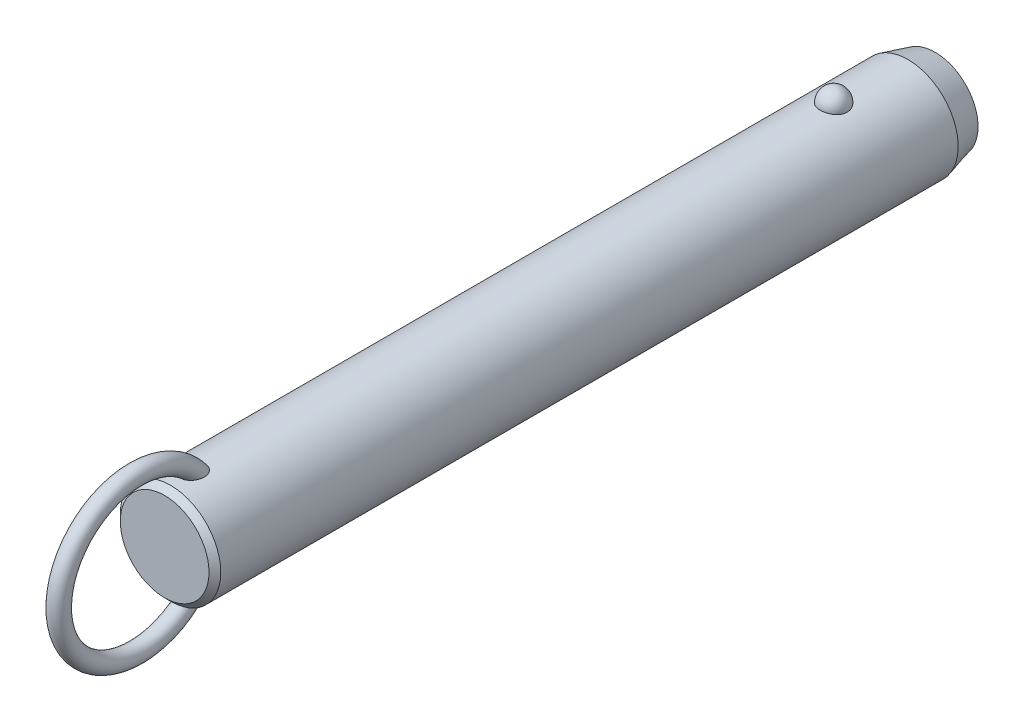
ISO-10303-21;
HEADER;
FILE_DESCRIPTION(('STEP AP214'),'2;1');
FILE_NAME('part.step','',(''),(''),'','','');
FILE_SCHEMA(('AUTOMOTIVE_DESIGN { 1 0 10303 214 1 1 1 1 }'));
ENDSEC;
DATA;
#1=APPLICATION_CONTEXT('core data for automotive mechanical design processes');
#2=APPLICATION_PROTOCOL_DEFINITION('international standard','automotive_design',2000,#1);
#3=PRODUCT_CONTEXT('',#1,'mechanical');
#4=PRODUCT('Part','Part','',(#3));
#5=PRODUCT_RELATED_PRODUCT_CATEGORY('part','',(#4));
#6=PRODUCT_DEFINITION_FORMATION('','',#4);
#7=PRODUCT_DEFINITION_CONTEXT('part definition',#1,'design');
#8=PRODUCT_DEFINITION('design','',#6,#7);
#9=PRODUCT_DEFINITION_SHAPE('','',#8);
#10=(LENGTH_UNIT() NAMED_UNIT(*) SI_UNIT(.MILLI.,.METRE.));
#11=(NAMED_UNIT(*) PLANE_ANGLE_UNIT() SI_UNIT($,.RADIAN.));
#12=(NAMED_UNIT(*) SI_UNIT($,.STERADIAN.) SOLID_ANGLE_UNIT());
#13=UNCERTAINTY_MEASURE_WITH_UNIT(LENGTH_MEASURE(1.E-05),#10,'distance_accuracy_value','');
#14=(GEOMETRIC_REPRESENTATION_CONTEXT(3) GLOBAL_UNCERTAINTY_ASSIGNED_CONTEXT((#13)) GLOBAL_UNIT_ASSIGNED_CONTEXT((#10,
#11,#12)) REPRESENTATION_CONTEXT('',''));
#15=CARTESIAN_POINT('',(0.,0.,0.));
#16=DIRECTION('',(0.,0.,1.));
#17=DIRECTION('',(1.,0.,0.));
#18=AXIS2_PLACEMENT_3D('',#15,#16,#17);
#19=CARTESIAN_POINT('',(0.,0.,132.1));
#20=DIRECTION('',(0.,0.,-1.));
#21=DIRECTION('',(-1.,0.,0.));
#22=AXIS2_PLACEMENT_3D('',#19,#20,#21);
#23=CYLINDRICAL_SURFACE('',#22,11.1);
#24=CARTESIAN_POINT('',(2.9724815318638,10.6945945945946,-3.));
#25=CARTESIAN_POINT('',(2.97247830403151,10.6945972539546,-2.83225059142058));
#26=CARTESIAN_POINT('',(2.95876598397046,10.6984356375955,-2.66445972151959));
#27=CARTESIAN_POINT('',(2.90424529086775,10.7133624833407,-2.33362381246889));
#28=CARTESIAN_POINT('',(2.8634252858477,10.7244540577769,-2.1705808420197));
#29=CARTESIAN_POINT('',(2.75573657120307,10.7526272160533,-1.85396767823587));
#30=CARTESIAN_POINT('',(2.68887937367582,10.7697061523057,-1.70039333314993));
#31=CARTESIAN_POINT('',(2.53079696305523,10.8079438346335,-1.40691598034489));
#32=CARTESIAN_POINT('',(2.43957264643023,10.8291024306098,-1.2670124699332));
#33=CARTESIAN_POINT('',(2.23458150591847,10.8732541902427,-1.00409565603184));
#34=CARTESIAN_POINT('',(2.12071295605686,10.8962553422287,-0.881162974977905));
#35=CARTESIAN_POINT('',(1.87365402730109,10.9414421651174,-0.656352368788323));
#36=CARTESIAN_POINT('',(1.74046358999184,10.9636278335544,-0.554474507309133));
#37=CARTESIAN_POINT('',(1.45872188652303,11.0046495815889,-0.374872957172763));
#38=CARTESIAN_POINT('',(1.31021276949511,11.0234944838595,-0.297085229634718));
#39=CARTESIAN_POINT('',(1.00170030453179,11.0557957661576,-0.167529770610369));
#40=CARTESIAN_POINT('',(0.841698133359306,11.0692526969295,-0.115759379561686));
#41=CARTESIAN_POINT('',(0.517607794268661,11.0890932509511,-0.0403925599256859));
#42=CARTESIAN_POINT('',(0.353633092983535,11.0955916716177,-0.0163383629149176));
#43=CARTESIAN_POINT('',(0.0238420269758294,11.1011989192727,0.0044517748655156));
#44=CARTESIAN_POINT('',(-0.141974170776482,11.1003084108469,0.00119017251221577));
#45=CARTESIAN_POINT('',(-0.468405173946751,11.0912990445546,-0.0323233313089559));
#46=CARTESIAN_POINT('',(-0.629059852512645,11.0832767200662,-0.0622147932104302));
#47=CARTESIAN_POINT('',(-0.942937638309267,11.0609962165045,-0.147645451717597));
#48=CARTESIAN_POINT('',(-1.09616062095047,11.0467379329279,-0.203185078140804));
#49=CARTESIAN_POINT('',(-1.39181061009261,11.0134071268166,-0.3387529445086));
#50=CARTESIAN_POINT('',(-1.53417383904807,10.9943086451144,-0.418913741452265));
#51=CARTESIAN_POINT('',(-1.80342160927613,10.9533667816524,-0.60144882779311));
#52=CARTESIAN_POINT('',(-1.9303046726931,10.9315231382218,-0.703825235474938));
#53=CARTESIAN_POINT('',(-2.16747598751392,10.887005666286,-0.930091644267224));
#54=CARTESIAN_POINT('',(-2.27742774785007,10.8643239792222,-1.05433291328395));
#55=CARTESIAN_POINT('',(-2.47517316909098,10.8209886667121,-1.31966633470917));
#56=CARTESIAN_POINT('',(-2.56296538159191,10.8003351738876,-1.46075958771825));
#57=CARTESIAN_POINT('',(-2.71500300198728,10.7631304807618,-1.75753646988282));
#58=CARTESIAN_POINT('',(-2.77898901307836,10.7466250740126,-1.91335887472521));
#59=CARTESIAN_POINT('',(-2.88046189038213,10.7198747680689,-2.2339152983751));
#60=CARTESIAN_POINT('',(-2.91794947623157,10.709629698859,-2.39864907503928));
#61=CARTESIAN_POINT('',(-2.96537819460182,10.6965949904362,-2.73165170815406));
#62=CARTESIAN_POINT('',(-2.97542891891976,10.693775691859,-2.89990378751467));
#63=CARTESIAN_POINT('',(-2.96804271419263,10.6958279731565,-3.235752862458));
#64=CARTESIAN_POINT('',(-2.95060646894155,10.7006993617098,-3.40334987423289));
#65=CARTESIAN_POINT('',(-2.88883358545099,10.71753912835,-3.73233906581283));
#66=CARTESIAN_POINT('',(-2.84462026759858,10.7294749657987,-3.89375610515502));
#67=CARTESIAN_POINT('',(-2.73050447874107,10.7590797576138,-4.20667949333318));
#68=CARTESIAN_POINT('',(-2.66060103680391,10.7767489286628,-4.35818546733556));
#69=CARTESIAN_POINT('',(-2.49642559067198,10.8159599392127,-4.6478542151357));
#70=CARTESIAN_POINT('',(-2.40203047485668,10.8375211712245,-4.78594458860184));
#71=CARTESIAN_POINT('',(-2.19143488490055,10.8820570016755,-5.0441038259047));
#72=CARTESIAN_POINT('',(-2.07523364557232,10.9050316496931,-5.16417205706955));
#73=CARTESIAN_POINT('',(-1.82361254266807,10.9499219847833,-5.38334833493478));
#74=CARTESIAN_POINT('',(-1.68812945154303,10.9718338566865,-5.48238464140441));
#75=CARTESIAN_POINT('',(-1.40191298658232,11.0120611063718,-5.65618873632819));
#76=CARTESIAN_POINT('',(-1.25118062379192,11.0303767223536,-5.73095813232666));
#77=CARTESIAN_POINT('',(-0.940570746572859,11.0611653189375,-5.85334725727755));
#78=CARTESIAN_POINT('',(-0.780821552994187,11.0737044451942,-5.90127578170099));
#79=CARTESIAN_POINT('',(-0.455204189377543,11.0918598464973,-5.96992976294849));
#80=CARTESIAN_POINT('',(-0.289336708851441,11.0974768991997,-5.99065827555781));
#81=CARTESIAN_POINT('',(0.0406846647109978,11.1011307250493,-6.00418773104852));
#82=CARTESIAN_POINT('',(0.204817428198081,11.099299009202,-5.99747318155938));
#83=CARTESIAN_POINT('',(0.5295530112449,11.088551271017,-5.9574031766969));
#84=CARTESIAN_POINT('',(0.69015594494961,11.0796354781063,-5.92404858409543));
#85=CARTESIAN_POINT('',(1.0027760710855,11.0557204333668,-5.83180084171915));
#86=CARTESIAN_POINT('',(1.15482001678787,11.0407414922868,-5.77299291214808));
#87=CARTESIAN_POINT('',(1.44678373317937,11.0062913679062,-5.63147366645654));
#88=CARTESIAN_POINT('',(1.58670279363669,10.9868199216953,-5.54876095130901));
#89=CARTESIAN_POINT('',(1.8527023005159,10.9451315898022,-5.36027644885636));
#90=CARTESIAN_POINT('',(1.97855158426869,10.9228788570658,-5.25418644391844));
#91=CARTESIAN_POINT('',(2.21080872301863,10.8782509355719,-5.02251354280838));
#92=CARTESIAN_POINT('',(2.31721312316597,10.8558757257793,-4.89692718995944));
#93=CARTESIAN_POINT('',(2.5094551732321,10.8130715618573,-4.62745408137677));
#94=CARTESIAN_POINT('',(2.59493284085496,10.7926798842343,-4.48330448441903));
#95=CARTESIAN_POINT('',(2.740862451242,10.7565495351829,-4.18236358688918));
#96=CARTESIAN_POINT('',(2.80132490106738,10.7408089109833,-4.02557762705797));
#97=CARTESIAN_POINT('',(2.88959070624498,10.7173718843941,-3.72475308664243));
#98=CARTESIAN_POINT('',(2.92062102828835,10.7088950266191,-3.58171216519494));
#99=CARTESIAN_POINT('',(2.96206765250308,10.6975052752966,-3.29245795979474));
#100=CARTESIAN_POINT('',(2.97248434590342,10.6945922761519,-3.14624473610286));
#101=CARTESIAN_POINT('',(2.9724815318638,10.6945945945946,-3.));
#102=B_SPLINE_CURVE_WITH_KNOTS('',3,(#24,#25,#26,#27,#28,#29,#30,#31,#32,#33,#34,#35,#36,#37,
#38,#39,#40,#41,#42,#43,#44,#45,#46,#47,#48,#49,#50,#51,#52,#53,#54,#55,#56,#57,#58,#59,#60,#61,
#62,#63,#64,#65,#66,#67,#68,#69,#70,#71,#72,#73,#74,#75,#76,#77,#78,#79,#80,#81,#82,#83,#84,#85,
#86,#87,#88,#89,#90,#91,#92,#93,#94,#95,#96,#97,#98,#99,#100,#101),.UNSPECIFIED.,.T.,.F.,(4,2,2,
2,2,2,2,2,2,2,2,2,2,2,2,2,2,2,2,2,2,2,2,2,2,2,2,2,2,2,2,2,2,2,2,2,2,2,4),(0.,0.502722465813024,
1.00566079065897,1.5083769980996,2.01107471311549,2.51608392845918,3.02109467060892,
3.52475118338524,4.02835620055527,4.523518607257,5.0186364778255,5.50715297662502,
5.9956776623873,6.48688002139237,6.97812923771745,7.47814366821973,7.9781907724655,
8.48353712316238,8.9888697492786,9.49218093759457,9.99547960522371,10.4964777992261,
10.997494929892,11.5010810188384,12.0046847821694,12.5099796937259,13.0152411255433,
13.5145635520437,14.0138298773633,14.5043200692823,14.9947943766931,15.4836390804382,
15.9725123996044,16.4685040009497,16.9645836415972,17.4686765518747,17.972557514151,
18.410841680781,18.849117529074),.UNSPECIFIED.);
#103=CARTESIAN_POINT('',(2.9724815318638,10.6945945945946,-3.));
#104=VERTEX_POINT('',#103);
#105=EDGE_CURVE('E41',#104,#104,#102,.T.);
#106=ORIENTED_EDGE('',*,*,#105,.T.);
#107=EDGE_LOOP('',(#106));
#108=FACE_BOUND('',#107,.T.);
#109=CARTESIAN_POINT('',(0.,0.,143.5));
#110=DIRECTION('',(0.,0.,1.));
#111=DIRECTION('',(1.,0.,0.));
#112=AXIS2_PLACEMENT_3D('',#109,#110,#111);
#113=CIRCLE('',#112,11.1);
#114=CARTESIAN_POINT('',(11.1,0.,143.5));
#115=VERTEX_POINT('',#114);
#116=EDGE_CURVE('E10',#115,#115,#113,.F.);
#117=ORIENTED_EDGE('',*,*,#116,.T.);
#118=EDGE_LOOP('',(#117));
#119=FACE_BOUND('',#118,.T.);
#120=CARTESIAN_POINT('',(-0.564520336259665,-11.0856356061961,135.757815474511));
#121=CARTESIAN_POINT('',(-0.667202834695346,-11.0804062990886,135.791283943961));
#122=CARTESIAN_POINT('',(-0.766875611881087,-11.0738877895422,135.833835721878));
#123=CARTESIAN_POINT('',(-0.95728412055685,-11.0590576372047,135.935419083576));
#124=CARTESIAN_POINT('',(-1.04801616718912,-11.0507452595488,135.99445742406));
#125=CARTESIAN_POINT('',(-1.21800952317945,-11.0333016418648,136.126529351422));
#126=CARTESIAN_POINT('',(-1.2973080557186,-11.0241732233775,136.199515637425));
#127=CARTESIAN_POINT('',(-1.44337665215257,-11.0060026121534,136.357037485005));
#128=CARTESIAN_POINT('',(-1.51014622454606,-10.9969604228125,136.441573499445));
#129=CARTESIAN_POINT('',(-1.63454620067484,-10.9791841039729,136.625521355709));
#130=CARTESIAN_POINT('',(-1.69127003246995,-10.9705107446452,136.725549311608));
#131=CARTESIAN_POINT('',(-1.7898078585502,-10.9548648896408,136.932790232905));
#132=CARTESIAN_POINT('',(-1.83161214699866,-10.9478935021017,137.040007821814));
#133=CARTESIAN_POINT('',(-1.91557028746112,-10.9335803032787,137.305408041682));
#134=CARTESIAN_POINT('',(-1.95040620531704,-10.9273269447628,137.465980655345));
#135=CARTESIAN_POINT('',(-1.99388326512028,-10.9194709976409,137.790697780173));
#136=CARTESIAN_POINT('',(-2.00248051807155,-10.9178762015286,137.954847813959));
#137=CARTESIAN_POINT('',(-1.99551615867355,-10.9191578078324,138.324650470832));
#138=CARTESIAN_POINT('',(-1.9732206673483,-10.9232807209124,138.530191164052));
#139=CARTESIAN_POINT('',(-1.9152976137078,-10.9335244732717,138.833595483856));
#140=CARTESIAN_POINT('',(-1.89184575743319,-10.9376266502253,138.934088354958));
#141=CARTESIAN_POINT('',(-1.83700674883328,-10.9469720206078,139.132855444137));
#142=CARTESIAN_POINT('',(-1.80562070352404,-10.9522150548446,139.231129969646));
#143=CARTESIAN_POINT('',(-1.73463055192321,-10.9636837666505,139.425914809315));
#144=CARTESIAN_POINT('',(-1.69493416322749,-10.9699202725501,139.522390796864));
#145=CARTESIAN_POINT('',(-1.60745141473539,-10.9830806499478,139.711626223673));
#146=CARTESIAN_POINT('',(-1.55966150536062,-10.9900048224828,139.804384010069));
#147=CARTESIAN_POINT('',(-1.45591812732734,-11.0042280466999,139.984690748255));
#148=CARTESIAN_POINT('',(-1.40000013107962,-11.0115253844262,140.072260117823));
#149=CARTESIAN_POINT('',(-1.27937470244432,-11.0261911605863,140.241029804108));
#150=CARTESIAN_POINT('',(-1.21467835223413,-11.0335594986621,140.32223795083));
#151=CARTESIAN_POINT('',(-1.08218150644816,-11.0473027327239,140.469001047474));
#152=CARTESIAN_POINT('',(-1.01522633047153,-11.0537063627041,140.535309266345));
#153=CARTESIAN_POINT('',(-0.872952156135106,-11.065850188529,140.658378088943));
#154=CARTESIAN_POINT('',(-0.797642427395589,-11.0715911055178,140.715149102));
#155=CARTESIAN_POINT('',(-0.651396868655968,-11.081071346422,140.807515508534));
#156=CARTESIAN_POINT('',(-0.581712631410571,-11.0849841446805,140.845049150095));
#157=CARTESIAN_POINT('',(-0.43706608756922,-11.0916271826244,140.908259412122));
#158=CARTESIAN_POINT('',(-0.362109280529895,-11.0943586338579,140.933948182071));
#159=CARTESIAN_POINT('',(-0.207828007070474,-11.0983242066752,140.971117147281));
#160=CARTESIAN_POINT('',(-0.12846771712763,-11.0995432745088,140.982454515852));
#161=CARTESIAN_POINT('',(0.0309101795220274,-11.1002423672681,140.988965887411));
#162=CARTESIAN_POINT('',(0.110927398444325,-11.0997233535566,140.984148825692));
#163=CARTESIAN_POINT('',(0.25640659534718,-11.097240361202,140.960959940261));
#164=CARTESIAN_POINT('',(0.322235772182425,-11.0955074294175,140.944754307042));
#165=CARTESIAN_POINT('',(0.450635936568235,-11.0910350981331,140.902600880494));
#166=CARTESIAN_POINT('',(0.513205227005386,-11.0882951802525,140.876648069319));
#167=CARTESIAN_POINT('',(0.662626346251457,-11.0805620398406,140.802607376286));
#168=CARTESIAN_POINT('',(0.747127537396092,-11.0751144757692,140.749845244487));
#169=CARTESIAN_POINT('',(0.906756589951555,-11.0631932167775,140.631720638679));
#170=CARTESIAN_POINT('',(0.981859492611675,-11.0567168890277,140.566325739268));
#171=CARTESIAN_POINT('',(1.10712207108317,-11.0447856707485,140.44226337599));
#172=CARTESIAN_POINT('',(1.15909566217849,-11.0394280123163,140.385383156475));
#173=CARTESIAN_POINT('',(1.2579192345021,-11.0286040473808,140.267327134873));
#174=CARTESIAN_POINT('',(1.30476642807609,-11.0231376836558,140.206149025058));
#175=CARTESIAN_POINT('',(1.43818612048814,-11.0068027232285,140.017305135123));
#176=CARTESIAN_POINT('',(1.51751767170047,-10.9960104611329,139.884453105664));
#177=CARTESIAN_POINT('',(1.63597546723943,-10.9788847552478,139.653137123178));
#178=CARTESIAN_POINT('',(1.67988876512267,-10.9722190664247,139.557053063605));
#179=CARTESIAN_POINT('',(1.75953241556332,-10.9597298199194,139.361431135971));
#180=CARTESIAN_POINT('',(1.7952596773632,-10.9539065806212,139.261891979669));
#181=CARTESIAN_POINT('',(1.85844731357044,-10.9433632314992,139.06021118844));
#182=CARTESIAN_POINT('',(1.88591073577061,-10.9386427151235,138.95807052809));
#183=CARTESIAN_POINT('',(1.93234324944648,-10.9305350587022,138.751819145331));
#184=CARTESIAN_POINT('',(1.95131065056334,-10.9271481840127,138.647708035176));
#185=CARTESIAN_POINT('',(1.9904020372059,-10.9201183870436,138.365458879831));
#186=CARTESIAN_POINT('',(2.00221217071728,-10.9179256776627,138.186037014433));
#187=CARTESIAN_POINT('',(1.99711676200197,-10.9188636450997,137.827713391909));
#188=CARTESIAN_POINT('',(1.98026150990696,-10.9219849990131,137.648811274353));
#189=CARTESIAN_POINT('',(1.92151657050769,-10.9324473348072,137.33645144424));
#190=CARTESIAN_POINT('',(1.88605081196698,-10.9386915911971,137.201759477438));
#191=CARTESIAN_POINT('',(1.79393020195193,-10.9541780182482,136.939966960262));
#192=CARTESIAN_POINT('',(1.73729868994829,-10.9634168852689,136.812858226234));
#193=CARTESIAN_POINT('',(1.61237037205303,-10.9824218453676,136.589418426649));
#194=CARTESIAN_POINT('',(1.54715374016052,-10.9918945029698,136.491345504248));
#195=CARTESIAN_POINT('',(1.40127026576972,-11.0114415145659,136.307434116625));
#196=CARTESIAN_POINT('',(1.32060742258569,-11.0215157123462,136.221592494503));
#197=CARTESIAN_POINT('',(1.1447478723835,-11.041168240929,136.065163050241));
#198=CARTESIAN_POINT('',(1.04947805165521,-11.0507437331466,135.994656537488));
#199=CARTESIAN_POINT('',(0.847278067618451,-11.0680789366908,135.872640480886));
#200=CARTESIAN_POINT('',(0.740351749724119,-11.0758392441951,135.821124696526));
#201=CARTESIAN_POINT('',(0.529289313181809,-11.0878275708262,135.743485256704));
#202=CARTESIAN_POINT('',(0.425895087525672,-11.0923259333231,135.715377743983));
#203=CARTESIAN_POINT('',(0.215723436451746,-11.0984001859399,135.677703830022));
#204=CARTESIAN_POINT('',(0.10894793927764,-11.0999777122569,135.668127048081));
#205=CARTESIAN_POINT('',(-0.0938962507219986,-11.1000196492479,135.667877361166));
#206=CARTESIAN_POINT('',(-0.189967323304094,-11.0987797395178,135.675408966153));
#207=CARTESIAN_POINT('',(-0.379657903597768,-11.0939111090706,135.705507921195));
#208=CARTESIAN_POINT('',(-0.47327735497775,-11.0902823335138,135.728075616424));
#209=CARTESIAN_POINT('',(-0.564520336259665,-11.0856356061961,135.757815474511));
#210=B_SPLINE_CURVE_WITH_KNOTS('',3,(#120,#121,#122,#123,#124,#125,#126,#127,#128,#129,#130,
#131,#132,#133,#134,#135,#136,#137,#138,#139,#140,#141,#142,#143,#144,#145,#146,#147,#148,#149,
#150,#151,#152,#153,#154,#155,#156,#157,#158,#159,#160,#161,#162,#163,#164,#165,#166,#167,#168,
#169,#170,#171,#172,#173,#174,#175,#176,#177,#178,#179,#180,#181,#182,#183,#184,#185,#186,#187,
#188,#189,#190,#191,#192,#193,#194,#195,#196,#197,#198,#199,#200,#201,#202,#203,#204,#205,#206,
#207,#208,#209),.UNSPECIFIED.,.T.,.F.,(4,2,2,2,2,2,2,2,2,2,2,2,2,2,2,2,2,2,2,2,2,2,2,2,2,2,2,2,
2,2,2,2,2,2,2,2,2,2,2,2,2,2,2,2,4),(0.,0.323999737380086,0.64813245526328,0.971184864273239,
1.29424994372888,1.63886237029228,1.98369857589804,2.47426059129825,2.96564271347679,
3.58257396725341,3.89215258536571,4.20168803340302,4.51486273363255,4.82817514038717,
5.14015911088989,5.45175282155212,5.73442856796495,6.01679375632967,6.2536458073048,
6.49025437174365,6.72919963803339,6.96801276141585,7.17061258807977,7.37331685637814,
7.67094989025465,7.96935728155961,8.20075067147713,8.43226927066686,8.89581623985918,
9.21306533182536,9.53043400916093,9.84768549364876,10.1650000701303,10.7022930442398,
11.2386443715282,11.655339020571,12.071575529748,12.4245637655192,12.7774607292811,
13.1321855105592,13.4867936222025,13.8068771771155,14.1267813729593,14.4146787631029,
14.7025827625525),.UNSPECIFIED.);
#211=CARTESIAN_POINT('',(-0.564520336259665,-11.0856356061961,135.757815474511));
#212=VERTEX_POINT('',#211);
#213=EDGE_CURVE('E59',#212,#212,#210,.T.);
#214=ORIENTED_EDGE('',*,*,#213,.T.);
#215=EDGE_LOOP('',(#214));
#216=FACE_BOUND('',#215,.T.);
#217=CARTESIAN_POINT('',(-0.564520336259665,11.0856356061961,135.757815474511));
#218=CARTESIAN_POINT('',(-0.468542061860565,11.0905203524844,135.726545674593));
#219=CARTESIAN_POINT('',(-0.369793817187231,11.0942886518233,135.703157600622));
#220=CARTESIAN_POINT('',(-0.169555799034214,11.0991586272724,135.673085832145));
#221=CARTESIAN_POINT('',(-0.0680604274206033,11.1002543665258,135.66643932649));
#222=CARTESIAN_POINT('',(0.134549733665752,11.099646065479,135.670157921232));
#223=CARTESIAN_POINT('',(0.235664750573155,11.0979441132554,135.68051033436));
#224=CARTESIAN_POINT('',(0.434632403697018,11.0919342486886,135.717831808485));
#225=CARTESIAN_POINT('',(0.532486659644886,11.0876276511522,135.744792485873));
#226=CARTESIAN_POINT('',(0.722445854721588,11.0768742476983,135.8144096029));
#227=CARTESIAN_POINT('',(0.814543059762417,11.0704246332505,135.857086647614));
#228=CARTESIAN_POINT('',(0.990565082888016,11.0560659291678,135.956648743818));
#229=CARTESIAN_POINT('',(1.07448844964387,11.048156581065,136.013536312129));
#230=CARTESIAN_POINT('',(1.23562672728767,11.0313221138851,136.142210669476));
#231=CARTESIAN_POINT('',(1.3124268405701,11.0223686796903,136.214511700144));
#232=CARTESIAN_POINT('',(1.45398030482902,11.0045918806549,136.370042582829));
#233=CARTESIAN_POINT('',(1.51873073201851,10.9957685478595,136.453275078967));
#234=CARTESIAN_POINT('',(1.64107232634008,10.9782087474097,136.636384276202));
#235=CARTESIAN_POINT('',(1.6974317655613,10.9695572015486,136.737089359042));
#236=CARTESIAN_POINT('',(1.79515063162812,10.9539887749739,136.945626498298));
#237=CARTESIAN_POINT('',(1.83649966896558,10.9470730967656,137.05346343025));
#238=CARTESIAN_POINT('',(1.91931148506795,10.9329211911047,137.320399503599));
#239=CARTESIAN_POINT('',(1.95340104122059,10.9267904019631,137.481861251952));
#240=CARTESIAN_POINT('',(1.99526195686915,10.9192174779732,137.80821631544));
#241=CARTESIAN_POINT('',(2.00298989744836,10.9177830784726,137.97311484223));
#242=CARTESIAN_POINT('',(1.99396251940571,10.9194420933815,138.344100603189));
#243=CARTESIAN_POINT('',(1.97050829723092,10.923774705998,138.55003871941));
#244=CARTESIAN_POINT('',(1.91079643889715,10.9343131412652,138.853901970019));
#245=CARTESIAN_POINT('',(1.88673702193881,10.9385106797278,138.954529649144));
#246=CARTESIAN_POINT('',(1.8306550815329,10.9480376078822,139.153510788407));
#247=CARTESIAN_POINT('',(1.79863369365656,10.9533668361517,139.251864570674));
#248=CARTESIAN_POINT('',(1.72633365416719,10.9649954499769,139.446720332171));
#249=CARTESIAN_POINT('',(1.68596409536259,10.9713053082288,139.54318790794));
#250=CARTESIAN_POINT('',(1.59707998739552,10.9845964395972,139.732323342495));
#251=CARTESIAN_POINT('',(1.54856169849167,10.9915780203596,139.824989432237));
#252=CARTESIAN_POINT('',(1.44330168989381,11.0058935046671,140.004975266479));
#253=CARTESIAN_POINT('',(1.3865974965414,11.0132257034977,140.092316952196));
#254=CARTESIAN_POINT('',(1.2643115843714,11.0279330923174,140.260456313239));
#255=CARTESIAN_POINT('',(1.19874160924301,11.0353082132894,140.341262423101));
#256=CARTESIAN_POINT('',(1.06542088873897,11.048931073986,140.485985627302));
#257=CARTESIAN_POINT('',(0.998640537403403,11.0552153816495,140.550784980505));
#258=CARTESIAN_POINT('',(0.856896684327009,11.0671032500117,140.670846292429));
#259=CARTESIAN_POINT('',(0.781942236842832,11.0727075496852,140.726118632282));
#260=CARTESIAN_POINT('',(0.636276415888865,11.081949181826,140.815972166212));
#261=CARTESIAN_POINT('',(0.566755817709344,11.0857572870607,140.852441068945));
#262=CARTESIAN_POINT('',(0.422602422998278,11.0921860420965,140.913533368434));
#263=CARTESIAN_POINT('',(0.347974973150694,11.0948079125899,140.938168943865));
#264=CARTESIAN_POINT('',(0.194593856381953,11.0985608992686,140.973323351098));
#265=CARTESIAN_POINT('',(0.115807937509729,11.0996777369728,140.983706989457));
#266=CARTESIAN_POINT('',(-0.0422499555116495,11.1002003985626,140.988574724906));
#267=CARTESIAN_POINT('',(-0.121521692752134,11.09960699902,140.983066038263));
#268=CARTESIAN_POINT('',(-0.26604624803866,11.0970123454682,140.958827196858));
#269=CARTESIAN_POINT('',(-0.331661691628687,11.0952283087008,140.942135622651));
#270=CARTESIAN_POINT('',(-0.459588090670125,11.0906663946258,140.899111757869));
#271=CARTESIAN_POINT('',(-0.521897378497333,11.0878880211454,140.872774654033));
#272=CARTESIAN_POINT('',(-0.671446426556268,11.0800342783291,140.797513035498));
#273=CARTESIAN_POINT('',(-0.756250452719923,11.0744969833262,140.743818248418));
#274=CARTESIAN_POINT('',(-0.916349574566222,11.0624045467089,140.623802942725));
#275=CARTESIAN_POINT('',(-0.991618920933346,11.0558467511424,140.557449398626));
#276=CARTESIAN_POINT('',(-1.11713140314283,11.0437783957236,140.431633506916));
#277=CARTESIAN_POINT('',(-1.16920539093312,11.0383619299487,140.373952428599));
#278=CARTESIAN_POINT('',(-1.26817476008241,11.02743010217,140.254280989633));
#279=CARTESIAN_POINT('',(-1.31506731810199,11.0219146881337,140.192288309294));
#280=CARTESIAN_POINT('',(-1.40399813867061,11.0109399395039,140.064784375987));
#281=CARTESIAN_POINT('',(-1.44602864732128,11.0054807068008,139.999267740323));
#282=CARTESIAN_POINT('',(-1.52538779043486,10.9947621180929,139.865422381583));
#283=CARTESIAN_POINT('',(-1.56271516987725,10.9895028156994,139.797092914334));
#284=CARTESIAN_POINT('',(-1.64537943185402,10.9774790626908,139.633210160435));
#285=CARTESIAN_POINT('',(-1.68879497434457,10.9708503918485,139.5366735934));
#286=CARTESIAN_POINT('',(-1.76740738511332,10.9584602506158,139.340236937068));
#287=CARTESIAN_POINT('',(-1.80260120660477,10.95269910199,139.24033561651));
#288=CARTESIAN_POINT('',(-1.86468657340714,10.9423003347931,139.037966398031));
#289=CARTESIAN_POINT('',(-1.8915816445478,10.9376622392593,138.935499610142));
#290=CARTESIAN_POINT('',(-1.93682458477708,10.9297405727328,138.728642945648));
#291=CARTESIAN_POINT('',(-1.95517082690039,10.9264572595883,138.624252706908));
#292=CARTESIAN_POINT('',(-1.99232562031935,10.9197647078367,138.34262876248));
#293=CARTESIAN_POINT('',(-2.00294603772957,10.9177914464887,138.164185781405));
#294=CARTESIAN_POINT('',(-1.99566675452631,10.9191290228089,137.807996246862));
#295=CARTESIAN_POINT('',(-1.97781651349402,10.9224306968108,137.63024902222));
#296=CARTESIAN_POINT('',(-1.91747214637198,10.9331592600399,137.319792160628));
#297=CARTESIAN_POINT('',(-1.88131022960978,10.9395108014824,137.185825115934));
#298=CARTESIAN_POINT('',(-1.78790380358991,10.9551659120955,136.92559757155));
#299=CARTESIAN_POINT('',(-1.73068309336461,10.9644661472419,136.799328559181));
#300=CARTESIAN_POINT('',(-1.60475573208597,10.9835398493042,136.57741565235));
#301=CARTESIAN_POINT('',(-1.53908879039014,10.9930297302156,136.480026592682));
#302=CARTESIAN_POINT('',(-1.39238608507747,11.0125708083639,136.297525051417));
#303=CARTESIAN_POINT('',(-1.31135150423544,11.0226219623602,136.212411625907));
#304=CARTESIAN_POINT('',(-1.14382035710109,11.0411991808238,136.06529943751));
#305=CARTESIAN_POINT('',(-1.0585850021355,11.0497792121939,136.00186930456));
#306=CARTESIAN_POINT('',(-0.878723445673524,11.0655285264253,135.890250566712));
#307=CARTESIAN_POINT('',(-0.784123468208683,11.0727015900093,135.842020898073));
#308=CARTESIAN_POINT('',(-0.646163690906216,11.0812501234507,135.786023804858));
#309=CARTESIAN_POINT('',(-0.605595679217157,11.0835451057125,135.771197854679));
#310=CARTESIAN_POINT('',(-0.564520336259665,11.0856356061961,135.757815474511));
#311=B_SPLINE_CURVE_WITH_KNOTS('',3,(#217,#218,#219,#220,#221,#222,#223,#224,#225,#226,#227,
#228,#229,#230,#231,#232,#233,#234,#235,#236,#237,#238,#239,#240,#241,#242,#243,#244,#245,#246,
#247,#248,#249,#250,#251,#252,#253,#254,#255,#256,#257,#258,#259,#260,#261,#262,#263,#264,#265,
#266,#267,#268,#269,#270,#271,#272,#273,#274,#275,#276,#277,#278,#279,#280,#281,#282,#283,#284,
#285,#286,#287,#288,#289,#290,#291,#292,#293,#294,#295,#296,#297,#298,#299,#300,#301,#302,#303,
#304,#305,#306,#307,#308,#309,#310),.UNSPECIFIED.,.T.,.F.,(4,2,2,2,2,2,2,2,2,2,2,2,2,2,2,2,2,2,
2,2,2,2,2,2,2,2,2,2,2,2,2,2,2,2,2,2,2,2,2,2,2,2,2,2,2,2,4),(0.,0.303061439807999,
0.606795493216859,0.910302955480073,1.21365733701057,1.51741085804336,1.82121821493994,
2.13745205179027,2.45376252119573,2.79958678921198,3.14564996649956,3.63832391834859,
4.13180893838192,4.75031912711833,5.06071926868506,5.37107516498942,5.6850077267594,
5.99908475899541,6.31176519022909,6.62403542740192,6.90315673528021,7.18197194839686,
7.41687778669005,7.65154134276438,7.88841587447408,8.12518286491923,8.32752842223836,
8.52997509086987,8.82986421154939,9.13054668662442,9.36393502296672,9.59744991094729,
9.83133221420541,10.0652767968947,10.383032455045,10.7009056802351,11.0186436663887,
11.3364420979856,11.8705925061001,12.4038159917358,12.8189662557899,13.2336487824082,
13.5857049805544,13.9377340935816,14.2561354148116,14.5736690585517,14.7033687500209),.UNSPECIFIED.);
#312=CARTESIAN_POINT('',(-0.564520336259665,11.0856356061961,135.757815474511));
#313=VERTEX_POINT('',#312);
#314=EDGE_CURVE('E67',#313,#313,#311,.T.);
#315=ORIENTED_EDGE('',*,*,#314,.T.);
#316=EDGE_LOOP('',(#315));
#317=FACE_BOUND('',#316,.T.);
#318=CARTESIAN_POINT('',(0.,0.,-19.3999999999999));
#319=DIRECTION('',(0.,0.,-1.));
#320=DIRECTION('',(-1.,0.,0.));
#321=AXIS2_PLACEMENT_3D('',#318,#319,#320);
#322=CIRCLE('',#321,11.1);
#323=CARTESIAN_POINT('',(-11.1,0.,-19.3999999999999));
#324=VERTEX_POINT('',#323);
#325=EDGE_CURVE('E56',#324,#324,#322,.F.);
#326=ORIENTED_EDGE('',*,*,#325,.T.);
#327=EDGE_LOOP('',(#326));
#328=FACE_BOUND('',#327,.T.);
#329=ADVANCED_FACE('F37',(#108,#119,#216,#317,#328),#23,.T.);
#330=CARTESIAN_POINT('',(0.,0.,-25.4));
#331=DIRECTION('',(0.,0.,-1.));
#332=DIRECTION('',(-1.,0.,0.));
#333=AXIS2_PLACEMENT_3D('',#330,#331,#332);
#334=PLANE('',#333);
#335=CARTESIAN_POINT('',(0.,0.,-25.4));
#336=DIRECTION('',(0.,0.,-1.));
#337=DIRECTION('',(-1.,0.,0.));
#338=AXIS2_PLACEMENT_3D('',#335,#336,#337);
#339=CIRCLE('',#338,9.49230484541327);
#340=CARTESIAN_POINT('',(-9.49230484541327,0.,-25.4));
#341=VERTEX_POINT('',#340);
#342=EDGE_CURVE('E66',#341,#341,#339,.T.);
#343=ORIENTED_EDGE('',*,*,#342,.T.);
#344=EDGE_LOOP('',(#343));
#345=FACE_BOUND('',#344,.T.);
#346=ADVANCED_FACE('F85',(#345),#334,.T.);
#347=CARTESIAN_POINT('',(0.,0.,-25.4));
#348=DIRECTION('',(0.,0.,1.));
#349=DIRECTION('',(1.,0.,0.));
#350=AXIS2_PLACEMENT_3D('',#347,#348,#349);
#351=CONICAL_SURFACE('',#350,9.49230484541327,0.261799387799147);
#352=ORIENTED_EDGE('',*,*,#325,.F.);
#353=EDGE_LOOP('',(#352));
#354=FACE_BOUND('',#353,.T.);
#355=ORIENTED_EDGE('',*,*,#342,.F.);
#356=EDGE_LOOP('',(#355));
#357=FACE_BOUND('',#356,.T.);
#358=ADVANCED_FACE('F83',(#354,#357),#351,.T.);
#359=CARTESIAN_POINT('',(0.,0.,144.8));
#360=DIRECTION('',(0.,0.,1.));
#361=DIRECTION('',(1.,0.,0.));
#362=AXIS2_PLACEMENT_3D('',#359,#360,#361);
#363=PLANE('',#362);
#364=CARTESIAN_POINT('',(0.,0.,144.8));
#365=DIRECTION('',(0.,0.,1.));
#366=DIRECTION('',(1.,0.,0.));
#367=AXIS2_PLACEMENT_3D('',#364,#365,#366);
#368=CIRCLE('',#367,9.8);
#369=CARTESIAN_POINT('',(9.8,0.,144.8));
#370=VERTEX_POINT('',#369);
#371=EDGE_CURVE('E50',#370,#370,#368,.T.);
#372=ORIENTED_EDGE('',*,*,#371,.T.);
#373=EDGE_LOOP('',(#372));
#374=FACE_BOUND('',#373,.T.);
#375=ADVANCED_FACE('F77',(#374),#363,.T.);
#376=CARTESIAN_POINT('',(0.,0.,151.15));
#377=DIRECTION('',(1.,0.,0.));
#378=DIRECTION('',(0.,0.,-1.));
#379=AXIS2_PLACEMENT_3D('',#376,#377,#378);
#380=TOROIDAL_SURFACE('',#379,17.05,2.);
#381=ORIENTED_EDGE('',*,*,#314,.F.);
#382=EDGE_LOOP('',(#381));
#383=FACE_BOUND('',#382,.T.);
#384=ORIENTED_EDGE('',*,*,#213,.F.);
#385=EDGE_LOOP('',(#384));
#386=FACE_BOUND('',#385,.T.);
#387=ADVANCED_FACE('F73',(#383,#386),#380,.T.);
#388=CARTESIAN_POINT('',(0.,0.,144.8));
#389=DIRECTION('',(0.,0.,-1.));
#390=DIRECTION('',(-1.,0.,0.));
#391=AXIS2_PLACEMENT_3D('',#388,#389,#390);
#392=CONICAL_SURFACE('',#391,9.8,0.785398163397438);
#393=ORIENTED_EDGE('',*,*,#116,.F.);
#394=EDGE_LOOP('',(#393));
#395=FACE_BOUND('',#394,.T.);
#396=ORIENTED_EDGE('',*,*,#371,.F.);
#397=EDGE_LOOP('',(#396));
#398=FACE_BOUND('',#397,.T.);
#399=ADVANCED_FACE('F39',(#395,#398),#392,.T.);
#400=CARTESIAN_POINT('',(0.,11.1,-3.));
#401=DIRECTION('',(0.,1.,0.));
#402=DIRECTION('',(0.,0.,-1.));
#403=AXIS2_PLACEMENT_3D('',#400,#401,#402);
#404=SPHERICAL_SURFACE('',#403,3.);
#405=ORIENTED_EDGE('',*,*,#105,.F.);
#406=EDGE_LOOP('',(#405));
#407=FACE_BOUND('',#406,.T.);
#408=ADVANCED_FACE('F79',(#407),#404,.T.);
#409=CLOSED_SHELL('',(#329,#346,#358,#375,#387,#399,#408));
#410=MANIFOLD_SOLID_BREP('B2',#409);
#411=ADVANCED_BREP_SHAPE_REPRESENTATION('',(#18,#410),#14);
#412=SHAPE_DEFINITION_REPRESENTATION(#9,#411);
ENDSEC;
END-ISO-10303-21;
